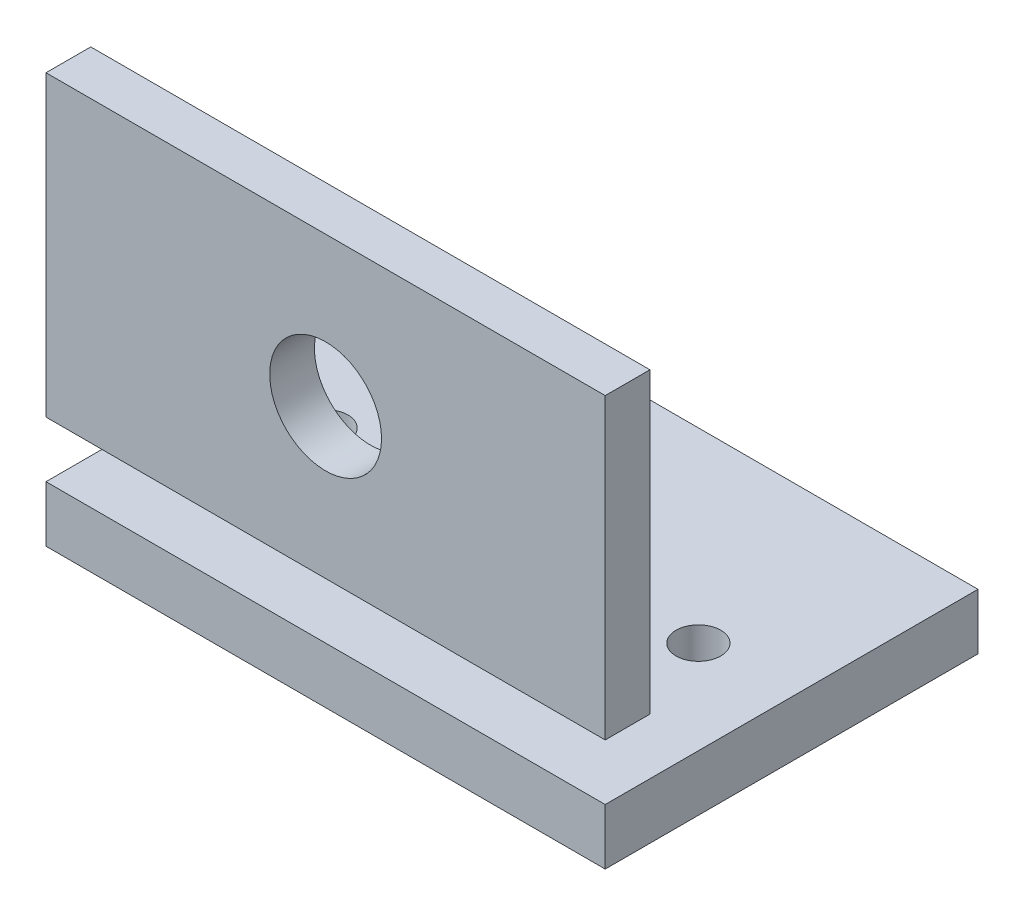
from build123d import *

# Parameters (mm, degrees)
BASESKETCH_W        = 150
BASESKETCH_H        = 100
BASEBOSS_DEPTH      = 15
MOUNTHOLESSKETCH_R  = 6
MOUNTHOLESCUT_DEPTH = 15
UPRIGHTSKETCH_W     = 150
UPRIGHTSKETCH_H     = 80
UPRIGHTBOSS_DEPTH   = 12
SHAFTBORESKETCH_R   = 15
SHAFTBORECUT_DEPTH  = 12


with BuildPart() as part:
    # BaseSketch → BaseBoss (new body)
    with BuildSketch(Plane(origin=(0, 0, 0), x_dir=(1, 0, 0), z_dir=(0, 1, 0))):
        with Locations((75, 50)):
            Rectangle(BASESKETCH_W, BASESKETCH_H)
    extrude(amount=-BASEBOSS_DEPTH)

    # MountHolesSketch → MountHolesCut (cut)
    with BuildSketch(Plane(origin=(0, 0, 0), x_dir=(1, 0, 0), z_dir=(0, 1, 0))):
        with Locations(Location((25, 50, 0), (0, 0, 270))):
            Circle(MOUNTHOLESSKETCH_R)
        with Locations(Location((125, 50, 0), (0, 0, 270))):
            Circle(MOUNTHOLESSKETCH_R)
    extrude(amount=-MOUNTHOLESCUT_DEPTH, mode=Mode.SUBTRACT)


with BuildPart() as body_2:
    # UprightSketch → UprightBoss (new body)
    with BuildSketch(Plane.XY):
        with Locations((75, 55)):
            Rectangle(UPRIGHTSKETCH_W, UPRIGHTSKETCH_H)
    extrude(amount=-UPRIGHTBOSS_DEPTH)

    # ShaftBoreSketch → ShaftBoreCut (cut)
    with BuildSketch(Plane.XY):
        with Locations((75, 55)):
            Circle(SHAFTBORESKETCH_R)
    extrude(amount=-SHAFTBORECUT_DEPTH, mode=Mode.SUBTRACT)


solid = Compound([part.part, body_2.part])
